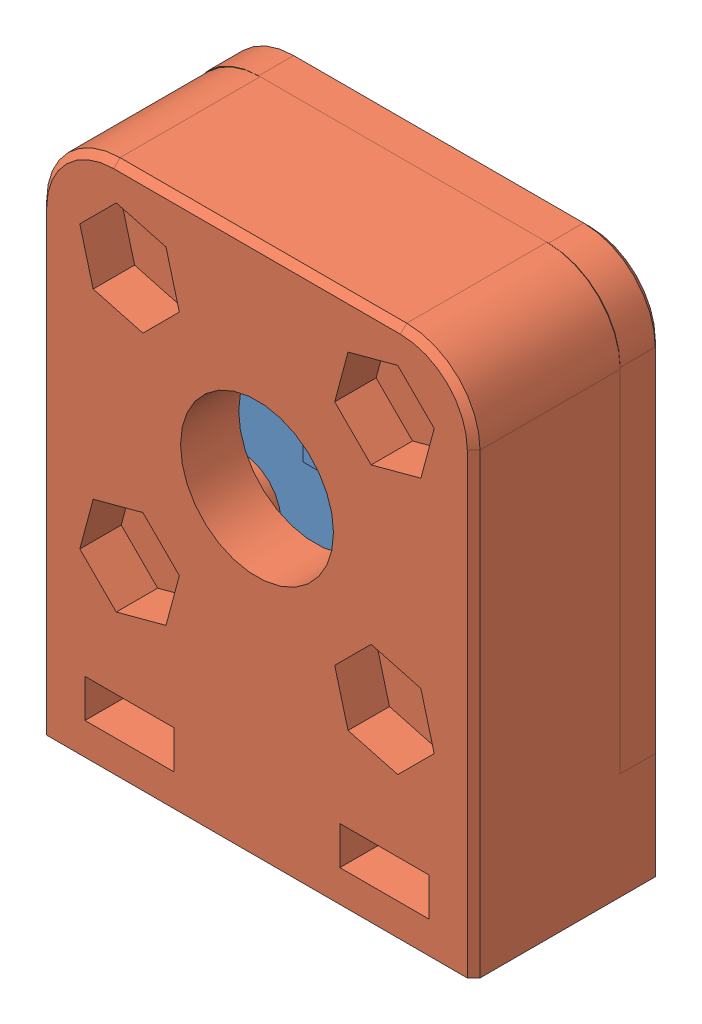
SolidWorks assembly Encoder.SLDASM, configuration Výchozí (file format 7000). Lengths in mm.
Overall size (27.2 33.3 11.8).
3 component instances, 2 part files, 6 mates.
Components (placement in the parent):
- AS5600-1: AS5600.SLDPRT [Výchozí] at origin size (23.5 23 3.2)
- Skrin-1: Skrin.SLDPRT [Skříň] at (0 0 -0.6) size (27.2 33.3 11.8)
- Skrin-2: Skrin.SLDPRT [Víko] at (0 0 -0.6) size (27.2 26.6 3.2)
Mates (geometry in assembly coordinates):
- Soustředná17: concentric aligned: cylinder of AS5600-1 through (-8 8 1.6) axis (0 0 -1) radius 1.6; cylinder of Skrin-1 through (-8 8 4.6) axis (0 0 -1) radius 1.6
- Soustředná18: concentric aligned: cylinder of AS5600-1 through (8 -8 1.6) axis (0 0 -1) radius 1.6; cylinder of Skrin-1 through (8 -8 4.6) axis (0 0 -1) radius 1.6
- Sjednocená27: coincident anti-aligned: plane of AS5600-1 through (0 0 1.6) normal (0 0 1); plane of Skrin-1 through (8 -8 1.6) normal (0 0 -1)
- Soustředná19: concentric aligned: cylinder of AS5600-1 through (8 8 1.6) axis (0 0 -1) radius 1.6; cylinder of Skrin-2 through (8 8 0) axis (0 0 -1) radius 1.6
- Soustředná20: concentric aligned: cylinder of AS5600-1 through (-8 -8 1.6) axis (0 0 -1) radius 1.6; cylinder of Skrin-2 through (-8 -8 0) axis (0 0 -1) radius 1.6
- Sjednocená28: coincident anti-aligned: plane of Skrin-1 through (0 0 -0.6) normal (0 0 -1); plane of Skrin-2 through (0 0 -0.6) normal (0 0 1)
